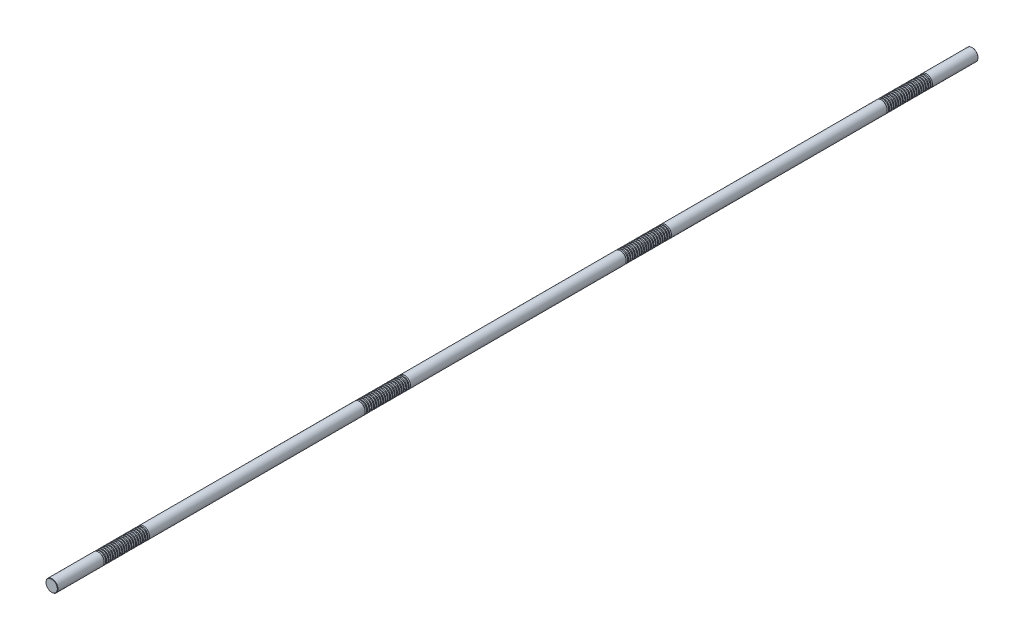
from build123d import *

# Parameters (mm, degrees)
SKETCH1_R           = 13
BOSS_EXTRUDE1_DEPTH = 1000
CHAMFER1_SIZE       = 0.65
LPATTERN1_COUNT     = 20
LPATTERN1_PITCH     = 5
LPATTERN2_COUNT     = 4
LPATTERN2_PITCH     = 567


with BuildPart() as part:
    # Sketch1 → Boss-Extrude1 (new, symmetric)
    with BuildSketch(Plane.XY):
        Circle(SKETCH1_R)
    extrude(amount=BOSS_EXTRUDE1_DEPTH, both=True)

    # Chamfer1
    chamfer1_edges = [part.edges().sort_by_distance(p)[0] for p in [
        (-13, 0, -1000),
        (-13, 0, 1000),
    ]]
    chamfer(chamfer1_edges, length=CHAMFER1_SIZE)

    # Sketch2 → Cut-Revolve1 (revolve, cut)
    with BuildSketch(Plane(origin=(0, 0, 0), x_dir=(0, 0, -1), z_dir=(1, 0, 0)), mode=Mode.PRIVATE) as cut_revolve1_sk:
        Polygon((900.36843014, 13), (897.13156986, 13), (897.86843014, 10.25), (899.63156986, 10.25), align=None)
    cut_revolve1 = revolve(cut_revolve1_sk.sketch.rotate(Axis((0, 0, 1000), (0, 0, -1)), 90), axis=Axis((0, 0, 1000), (0, 0, -1)), mode=Mode.SUBTRACT)

    # LPattern1: Cut-Revolve1 ×20
    with Locations(*[(0, 0, i * LPATTERN1_PITCH) for i in range(1, LPATTERN1_COUNT)]):
        add(cut_revolve1, mode=Mode.SUBTRACT)

    # LPattern2: Cut-Revolve1 ×4
    with Locations(*[(0, 0, i * LPATTERN2_PITCH) for i in range(1, LPATTERN2_COUNT)]):
        add(cut_revolve1, mode=Mode.SUBTRACT)

    # LPattern2 copy 1 sketch → LPattern2 copy 1 (revolve, cut)
    with BuildSketch(Plane(origin=(0, 0, 572), x_dir=(0, 0, -1), z_dir=(1, 0, 0))):
        Polygon((900.36843014, 13), (897.13156986, 13), (897.86843014, 10.25), (899.63156986, 10.25), align=None)
    revolve(axis=Axis((0, 0, 1572), (0, 0, -1)), mode=Mode.SUBTRACT)

    # LPattern2 copy 2 sketch → LPattern2 copy 2 (revolve, cut)
    with BuildSketch(Plane(origin=(0, 0, 1139), x_dir=(0, 0, -1), z_dir=(1, 0, 0))):
        Polygon((900.36843014, 13), (897.13156986, 13), (897.86843014, 10.25), (899.63156986, 10.25), align=None)
    revolve(axis=Axis((0, 0, 2139), (0, 0, -1)), mode=Mode.SUBTRACT)

    # LPattern2 copy 3 sketch → LPattern2 copy 3 (revolve, cut)
    with BuildSketch(Plane(origin=(0, 0, 1706), x_dir=(0, 0, -1), z_dir=(1, 0, 0))):
        Polygon((900.36843014, 13), (897.13156986, 13), (897.86843014, 10.25), (899.63156986, 10.25), align=None)
    revolve(axis=Axis((0, 0, 2706), (0, 0, -1)), mode=Mode.SUBTRACT)

    # LPattern2 copy 4 sketch → LPattern2 copy 4 (revolve, cut)
    with BuildSketch(Plane(origin=(0, 0, 577), x_dir=(0, 0, -1), z_dir=(1, 0, 0))):
        Polygon((900.36843014, 13), (897.13156986, 13), (897.86843014, 10.25), (899.63156986, 10.25), align=None)
    revolve(axis=Axis((0, 0, 1577), (0, 0, -1)), mode=Mode.SUBTRACT)

    # LPattern2 copy 5 sketch → LPattern2 copy 5 (revolve, cut)
    with BuildSketch(Plane(origin=(0, 0, 1144), x_dir=(0, 0, -1), z_dir=(1, 0, 0))):
        Polygon((900.36843014, 13), (897.13156986, 13), (897.86843014, 10.25), (899.63156986, 10.25), align=None)
    revolve(axis=Axis((0, 0, 2144), (0, 0, -1)), mode=Mode.SUBTRACT)

    # LPattern2 copy 6 sketch → LPattern2 copy 6 (revolve, cut)
    with BuildSketch(Plane(origin=(0, 0, 1711), x_dir=(0, 0, -1), z_dir=(1, 0, 0))):
        Polygon((900.36843014, 13), (897.13156986, 13), (897.86843014, 10.25), (899.63156986, 10.25), align=None)
    revolve(axis=Axis((0, 0, 2711), (0, 0, -1)), mode=Mode.SUBTRACT)

    # LPattern2 copy 7 sketch → LPattern2 copy 7 (revolve, cut)
    with BuildSketch(Plane(origin=(0, 0, 582), x_dir=(0, 0, -1), z_dir=(1, 0, 0))):
        Polygon((900.36843014, 13), (897.13156986, 13), (897.86843014, 10.25), (899.63156986, 10.25), align=None)
    revolve(axis=Axis((0, 0, 1582), (0, 0, -1)), mode=Mode.SUBTRACT)

    # LPattern2 copy 8 sketch → LPattern2 copy 8 (revolve, cut)
    with BuildSketch(Plane(origin=(0, 0, 1149), x_dir=(0, 0, -1), z_dir=(1, 0, 0))):
        Polygon((900.36843014, 13), (897.13156986, 13), (897.86843014, 10.25), (899.63156986, 10.25), align=None)
    revolve(axis=Axis((0, 0, 2149), (0, 0, -1)), mode=Mode.SUBTRACT)

    # LPattern2 copy 9 sketch → LPattern2 copy 9 (revolve, cut)
    with BuildSketch(Plane(origin=(0, 0, 1716), x_dir=(0, 0, -1), z_dir=(1, 0, 0))):
        Polygon((900.36843014, 13), (897.13156986, 13), (897.86843014, 10.25), (899.63156986, 10.25), align=None)
    revolve(axis=Axis((0, 0, 2716), (0, 0, -1)), mode=Mode.SUBTRACT)

    # LPattern2 copy 10 sketch → LPattern2 copy 10 (revolve, cut)
    with BuildSketch(Plane(origin=(0, 0, 587), x_dir=(0, 0, -1), z_dir=(1, 0, 0))):
        Polygon((900.36843014, 13), (897.13156986, 13), (897.86843014, 10.25), (899.63156986, 10.25), align=None)
    revolve(axis=Axis((0, 0, 1587), (0, 0, -1)), mode=Mode.SUBTRACT)

    # LPattern2 copy 11 sketch → LPattern2 copy 11 (revolve, cut)
    with BuildSketch(Plane(origin=(0, 0, 1154), x_dir=(0, 0, -1), z_dir=(1, 0, 0))):
        Polygon((900.36843014, 13), (897.13156986, 13), (897.86843014, 10.25), (899.63156986, 10.25), align=None)
    revolve(axis=Axis((0, 0, 2154), (0, 0, -1)), mode=Mode.SUBTRACT)

    # LPattern2 copy 12 sketch → LPattern2 copy 12 (revolve, cut)
    with BuildSketch(Plane(origin=(0, 0, 1721), x_dir=(0, 0, -1), z_dir=(1, 0, 0))):
        Polygon((900.36843014, 13), (897.13156986, 13), (897.86843014, 10.25), (899.63156986, 10.25), align=None)
    revolve(axis=Axis((0, 0, 2721), (0, 0, -1)), mode=Mode.SUBTRACT)

    # LPattern2 copy 13 sketch → LPattern2 copy 13 (revolve, cut)
    with BuildSketch(Plane(origin=(0, 0, 592), x_dir=(0, 0, -1), z_dir=(1, 0, 0))):
        Polygon((900.36843014, 13), (897.13156986, 13), (897.86843014, 10.25), (899.63156986, 10.25), align=None)
    revolve(axis=Axis((0, 0, 1592), (0, 0, -1)), mode=Mode.SUBTRACT)

    # LPattern2 copy 14 sketch → LPattern2 copy 14 (revolve, cut)
    with BuildSketch(Plane(origin=(0, 0, 1159), x_dir=(0, 0, -1), z_dir=(1, 0, 0))):
        Polygon((900.36843014, 13), (897.13156986, 13), (897.86843014, 10.25), (899.63156986, 10.25), align=None)
    revolve(axis=Axis((0, 0, 2159), (0, 0, -1)), mode=Mode.SUBTRACT)

    # LPattern2 copy 15 sketch → LPattern2 copy 15 (revolve, cut)
    with BuildSketch(Plane(origin=(0, 0, 1726), x_dir=(0, 0, -1), z_dir=(1, 0, 0))):
        Polygon((900.36843014, 13), (897.13156986, 13), (897.86843014, 10.25), (899.63156986, 10.25), align=None)
    revolve(axis=Axis((0, 0, 2726), (0, 0, -1)), mode=Mode.SUBTRACT)

    # LPattern2 copy 16 sketch → LPattern2 copy 16 (revolve, cut)
    with BuildSketch(Plane(origin=(0, 0, 597), x_dir=(0, 0, -1), z_dir=(1, 0, 0))):
        Polygon((900.36843014, 13), (897.13156986, 13), (897.86843014, 10.25), (899.63156986, 10.25), align=None)
    revolve(axis=Axis((0, 0, 1597), (0, 0, -1)), mode=Mode.SUBTRACT)

    # LPattern2 copy 17 sketch → LPattern2 copy 17 (revolve, cut)
    with BuildSketch(Plane(origin=(0, 0, 1164), x_dir=(0, 0, -1), z_dir=(1, 0, 0))):
        Polygon((900.36843014, 13), (897.13156986, 13), (897.86843014, 10.25), (899.63156986, 10.25), align=None)
    revolve(axis=Axis((0, 0, 2164), (0, 0, -1)), mode=Mode.SUBTRACT)

    # LPattern2 copy 18 sketch → LPattern2 copy 18 (revolve, cut)
    with BuildSketch(Plane(origin=(0, 0, 1731), x_dir=(0, 0, -1), z_dir=(1, 0, 0))):
        Polygon((900.36843014, 13), (897.13156986, 13), (897.86843014, 10.25), (899.63156986, 10.25), align=None)
    revolve(axis=Axis((0, 0, 2731), (0, 0, -1)), mode=Mode.SUBTRACT)

    # LPattern2 copy 19 sketch → LPattern2 copy 19 (revolve, cut)
    with BuildSketch(Plane(origin=(0, 0, 602), x_dir=(0, 0, -1), z_dir=(1, 0, 0))):
        Polygon((900.36843014, 13), (897.13156986, 13), (897.86843014, 10.25), (899.63156986, 10.25), align=None)
    revolve(axis=Axis((0, 0, 1602), (0, 0, -1)), mode=Mode.SUBTRACT)

    # LPattern2 copy 20 sketch → LPattern2 copy 20 (revolve, cut)
    with BuildSketch(Plane(origin=(0, 0, 1169), x_dir=(0, 0, -1), z_dir=(1, 0, 0))):
        Polygon((900.36843014, 13), (897.13156986, 13), (897.86843014, 10.25), (899.63156986, 10.25), align=None)
    revolve(axis=Axis((0, 0, 2169), (0, 0, -1)), mode=Mode.SUBTRACT)

    # LPattern2 copy 21 sketch → LPattern2 copy 21 (revolve, cut)
    with BuildSketch(Plane(origin=(0, 0, 1736), x_dir=(0, 0, -1), z_dir=(1, 0, 0))):
        Polygon((900.36843014, 13), (897.13156986, 13), (897.86843014, 10.25), (899.63156986, 10.25), align=None)
    revolve(axis=Axis((0, 0, 2736), (0, 0, -1)), mode=Mode.SUBTRACT)

    # LPattern2 copy 22 sketch → LPattern2 copy 22 (revolve, cut)
    with BuildSketch(Plane(origin=(0, 0, 607), x_dir=(0, 0, -1), z_dir=(1, 0, 0))):
        Polygon((900.36843014, 13), (897.13156986, 13), (897.86843014, 10.25), (899.63156986, 10.25), align=None)
    revolve(axis=Axis((0, 0, 1607), (0, 0, -1)), mode=Mode.SUBTRACT)

    # LPattern2 copy 23 sketch → LPattern2 copy 23 (revolve, cut)
    with BuildSketch(Plane(origin=(0, 0, 1174), x_dir=(0, 0, -1), z_dir=(1, 0, 0))):
        Polygon((900.36843014, 13), (897.13156986, 13), (897.86843014, 10.25), (899.63156986, 10.25), align=None)
    revolve(axis=Axis((0, 0, 2174), (0, 0, -1)), mode=Mode.SUBTRACT)

    # LPattern2 copy 24 sketch → LPattern2 copy 24 (revolve, cut)
    with BuildSketch(Plane(origin=(0, 0, 1741), x_dir=(0, 0, -1), z_dir=(1, 0, 0))):
        Polygon((900.36843014, 13), (897.13156986, 13), (897.86843014, 10.25), (899.63156986, 10.25), align=None)
    revolve(axis=Axis((0, 0, 2741), (0, 0, -1)), mode=Mode.SUBTRACT)

    # LPattern2 copy 25 sketch → LPattern2 copy 25 (revolve, cut)
    with BuildSketch(Plane(origin=(0, 0, 612), x_dir=(0, 0, -1), z_dir=(1, 0, 0))):
        Polygon((900.36843014, 13), (897.13156986, 13), (897.86843014, 10.25), (899.63156986, 10.25), align=None)
    revolve(axis=Axis((0, 0, 1612), (0, 0, -1)), mode=Mode.SUBTRACT)

    # LPattern2 copy 26 sketch → LPattern2 copy 26 (revolve, cut)
    with BuildSketch(Plane(origin=(0, 0, 1179), x_dir=(0, 0, -1), z_dir=(1, 0, 0))):
        Polygon((900.36843014, 13), (897.13156986, 13), (897.86843014, 10.25), (899.63156986, 10.25), align=None)
    revolve(axis=Axis((0, 0, 2179), (0, 0, -1)), mode=Mode.SUBTRACT)

    # LPattern2 copy 27 sketch → LPattern2 copy 27 (revolve, cut)
    with BuildSketch(Plane(origin=(0, 0, 1746), x_dir=(0, 0, -1), z_dir=(1, 0, 0))):
        Polygon((900.36843014, 13), (897.13156986, 13), (897.86843014, 10.25), (899.63156986, 10.25), align=None)
    revolve(axis=Axis((0, 0, 2746), (0, 0, -1)), mode=Mode.SUBTRACT)

    # LPattern2 copy 28 sketch → LPattern2 copy 28 (revolve, cut)
    with BuildSketch(Plane(origin=(0, 0, 617), x_dir=(0, 0, -1), z_dir=(1, 0, 0))):
        Polygon((900.36843014, 13), (897.13156986, 13), (897.86843014, 10.25), (899.63156986, 10.25), align=None)
    revolve(axis=Axis((0, 0, 1617), (0, 0, -1)), mode=Mode.SUBTRACT)

    # LPattern2 copy 29 sketch → LPattern2 copy 29 (revolve, cut)
    with BuildSketch(Plane(origin=(0, 0, 1184), x_dir=(0, 0, -1), z_dir=(1, 0, 0))):
        Polygon((900.36843014, 13), (897.13156986, 13), (897.86843014, 10.25), (899.63156986, 10.25), align=None)
    revolve(axis=Axis((0, 0, 2184), (0, 0, -1)), mode=Mode.SUBTRACT)

    # LPattern2 copy 30 sketch → LPattern2 copy 30 (revolve, cut)
    with BuildSketch(Plane(origin=(0, 0, 1751), x_dir=(0, 0, -1), z_dir=(1, 0, 0))):
        Polygon((900.36843014, 13), (897.13156986, 13), (897.86843014, 10.25), (899.63156986, 10.25), align=None)
    revolve(axis=Axis((0, 0, 2751), (0, 0, -1)), mode=Mode.SUBTRACT)

    # LPattern2 copy 31 sketch → LPattern2 copy 31 (revolve, cut)
    with BuildSketch(Plane(origin=(0, 0, 622), x_dir=(0, 0, -1), z_dir=(1, 0, 0))):
        Polygon((900.36843014, 13), (897.13156986, 13), (897.86843014, 10.25), (899.63156986, 10.25), align=None)
    revolve(axis=Axis((0, 0, 1622), (0, 0, -1)), mode=Mode.SUBTRACT)

    # LPattern2 copy 32 sketch → LPattern2 copy 32 (revolve, cut)
    with BuildSketch(Plane(origin=(0, 0, 1189), x_dir=(0, 0, -1), z_dir=(1, 0, 0))):
        Polygon((900.36843014, 13), (897.13156986, 13), (897.86843014, 10.25), (899.63156986, 10.25), align=None)
    revolve(axis=Axis((0, 0, 2189), (0, 0, -1)), mode=Mode.SUBTRACT)

    # LPattern2 copy 33 sketch → LPattern2 copy 33 (revolve, cut)
    with BuildSketch(Plane(origin=(0, 0, 1756), x_dir=(0, 0, -1), z_dir=(1, 0, 0))):
        Polygon((900.36843014, 13), (897.13156986, 13), (897.86843014, 10.25), (899.63156986, 10.25), align=None)
    revolve(axis=Axis((0, 0, 2756), (0, 0, -1)), mode=Mode.SUBTRACT)

    # LPattern2 copy 34 sketch → LPattern2 copy 34 (revolve, cut)
    with BuildSketch(Plane(origin=(0, 0, 627), x_dir=(0, 0, -1), z_dir=(1, 0, 0))):
        Polygon((900.36843014, 13), (897.13156986, 13), (897.86843014, 10.25), (899.63156986, 10.25), align=None)
    revolve(axis=Axis((0, 0, 1627), (0, 0, -1)), mode=Mode.SUBTRACT)

    # LPattern2 copy 35 sketch → LPattern2 copy 35 (revolve, cut)
    with BuildSketch(Plane(origin=(0, 0, 1194), x_dir=(0, 0, -1), z_dir=(1, 0, 0))):
        Polygon((900.36843014, 13), (897.13156986, 13), (897.86843014, 10.25), (899.63156986, 10.25), align=None)
    revolve(axis=Axis((0, 0, 2194), (0, 0, -1)), mode=Mode.SUBTRACT)

    # LPattern2 copy 36 sketch → LPattern2 copy 36 (revolve, cut)
    with BuildSketch(Plane(origin=(0, 0, 1761), x_dir=(0, 0, -1), z_dir=(1, 0, 0))):
        Polygon((900.36843014, 13), (897.13156986, 13), (897.86843014, 10.25), (899.63156986, 10.25), align=None)
    revolve(axis=Axis((0, 0, 2761), (0, 0, -1)), mode=Mode.SUBTRACT)

    # LPattern2 copy 37 sketch → LPattern2 copy 37 (revolve, cut)
    with BuildSketch(Plane(origin=(0, 0, 632), x_dir=(0, 0, -1), z_dir=(1, 0, 0))):
        Polygon((900.36843014, 13), (897.13156986, 13), (897.86843014, 10.25), (899.63156986, 10.25), align=None)
    revolve(axis=Axis((0, 0, 1632), (0, 0, -1)), mode=Mode.SUBTRACT)

    # LPattern2 copy 38 sketch → LPattern2 copy 38 (revolve, cut)
    with BuildSketch(Plane(origin=(0, 0, 1199), x_dir=(0, 0, -1), z_dir=(1, 0, 0))):
        Polygon((900.36843014, 13), (897.13156986, 13), (897.86843014, 10.25), (899.63156986, 10.25), align=None)
    revolve(axis=Axis((0, 0, 2199), (0, 0, -1)), mode=Mode.SUBTRACT)

    # LPattern2 copy 39 sketch → LPattern2 copy 39 (revolve, cut)
    with BuildSketch(Plane(origin=(0, 0, 1766), x_dir=(0, 0, -1), z_dir=(1, 0, 0))):
        Polygon((900.36843014, 13), (897.13156986, 13), (897.86843014, 10.25), (899.63156986, 10.25), align=None)
    revolve(axis=Axis((0, 0, 2766), (0, 0, -1)), mode=Mode.SUBTRACT)

    # LPattern2 copy 40 sketch → LPattern2 copy 40 (revolve, cut)
    with BuildSketch(Plane(origin=(0, 0, 637), x_dir=(0, 0, -1), z_dir=(1, 0, 0))):
        Polygon((900.36843014, 13), (897.13156986, 13), (897.86843014, 10.25), (899.63156986, 10.25), align=None)
    revolve(axis=Axis((0, 0, 1637), (0, 0, -1)), mode=Mode.SUBTRACT)

    # LPattern2 copy 41 sketch → LPattern2 copy 41 (revolve, cut)
    with BuildSketch(Plane(origin=(0, 0, 1204), x_dir=(0, 0, -1), z_dir=(1, 0, 0))):
        Polygon((900.36843014, 13), (897.13156986, 13), (897.86843014, 10.25), (899.63156986, 10.25), align=None)
    revolve(axis=Axis((0, 0, 2204), (0, 0, -1)), mode=Mode.SUBTRACT)

    # LPattern2 copy 42 sketch → LPattern2 copy 42 (revolve, cut)
    with BuildSketch(Plane(origin=(0, 0, 1771), x_dir=(0, 0, -1), z_dir=(1, 0, 0))):
        Polygon((900.36843014, 13), (897.13156986, 13), (897.86843014, 10.25), (899.63156986, 10.25), align=None)
    revolve(axis=Axis((0, 0, 2771), (0, 0, -1)), mode=Mode.SUBTRACT)

    # LPattern2 copy 43 sketch → LPattern2 copy 43 (revolve, cut)
    with BuildSketch(Plane(origin=(0, 0, 642), x_dir=(0, 0, -1), z_dir=(1, 0, 0))):
        Polygon((900.36843014, 13), (897.13156986, 13), (897.86843014, 10.25), (899.63156986, 10.25), align=None)
    revolve(axis=Axis((0, 0, 1642), (0, 0, -1)), mode=Mode.SUBTRACT)

    # LPattern2 copy 44 sketch → LPattern2 copy 44 (revolve, cut)
    with BuildSketch(Plane(origin=(0, 0, 1209), x_dir=(0, 0, -1), z_dir=(1, 0, 0))):
        Polygon((900.36843014, 13), (897.13156986, 13), (897.86843014, 10.25), (899.63156986, 10.25), align=None)
    revolve(axis=Axis((0, 0, 2209), (0, 0, -1)), mode=Mode.SUBTRACT)

    # LPattern2 copy 45 sketch → LPattern2 copy 45 (revolve, cut)
    with BuildSketch(Plane(origin=(0, 0, 1776), x_dir=(0, 0, -1), z_dir=(1, 0, 0))):
        Polygon((900.36843014, 13), (897.13156986, 13), (897.86843014, 10.25), (899.63156986, 10.25), align=None)
    revolve(axis=Axis((0, 0, 2776), (0, 0, -1)), mode=Mode.SUBTRACT)

    # LPattern2 copy 46 sketch → LPattern2 copy 46 (revolve, cut)
    with BuildSketch(Plane(origin=(0, 0, 647), x_dir=(0, 0, -1), z_dir=(1, 0, 0))):
        Polygon((900.36843014, 13), (897.13156986, 13), (897.86843014, 10.25), (899.63156986, 10.25), align=None)
    revolve(axis=Axis((0, 0, 1647), (0, 0, -1)), mode=Mode.SUBTRACT)

    # LPattern2 copy 47 sketch → LPattern2 copy 47 (revolve, cut)
    with BuildSketch(Plane(origin=(0, 0, 1214), x_dir=(0, 0, -1), z_dir=(1, 0, 0))):
        Polygon((900.36843014, 13), (897.13156986, 13), (897.86843014, 10.25), (899.63156986, 10.25), align=None)
    revolve(axis=Axis((0, 0, 2214), (0, 0, -1)), mode=Mode.SUBTRACT)

    # LPattern2 copy 48 sketch → LPattern2 copy 48 (revolve, cut)
    with BuildSketch(Plane(origin=(0, 0, 1781), x_dir=(0, 0, -1), z_dir=(1, 0, 0))):
        Polygon((900.36843014, 13), (897.13156986, 13), (897.86843014, 10.25), (899.63156986, 10.25), align=None)
    revolve(axis=Axis((0, 0, 2781), (0, 0, -1)), mode=Mode.SUBTRACT)

    # LPattern2 copy 49 sketch → LPattern2 copy 49 (revolve, cut)
    with BuildSketch(Plane(origin=(0, 0, 652), x_dir=(0, 0, -1), z_dir=(1, 0, 0))):
        Polygon((900.36843014, 13), (897.13156986, 13), (897.86843014, 10.25), (899.63156986, 10.25), align=None)
    revolve(axis=Axis((0, 0, 1652), (0, 0, -1)), mode=Mode.SUBTRACT)

    # LPattern2 copy 50 sketch → LPattern2 copy 50 (revolve, cut)
    with BuildSketch(Plane(origin=(0, 0, 1219), x_dir=(0, 0, -1), z_dir=(1, 0, 0))):
        Polygon((900.36843014, 13), (897.13156986, 13), (897.86843014, 10.25), (899.63156986, 10.25), align=None)
    revolve(axis=Axis((0, 0, 2219), (0, 0, -1)), mode=Mode.SUBTRACT)

    # LPattern2 copy 51 sketch → LPattern2 copy 51 (revolve, cut)
    with BuildSketch(Plane(origin=(0, 0, 1786), x_dir=(0, 0, -1), z_dir=(1, 0, 0))):
        Polygon((900.36843014, 13), (897.13156986, 13), (897.86843014, 10.25), (899.63156986, 10.25), align=None)
    revolve(axis=Axis((0, 0, 2786), (0, 0, -1)), mode=Mode.SUBTRACT)

    # LPattern2 copy 52 sketch → LPattern2 copy 52 (revolve, cut)
    with BuildSketch(Plane(origin=(0, 0, 657), x_dir=(0, 0, -1), z_dir=(1, 0, 0))):
        Polygon((900.36843014, 13), (897.13156986, 13), (897.86843014, 10.25), (899.63156986, 10.25), align=None)
    revolve(axis=Axis((0, 0, 1657), (0, 0, -1)), mode=Mode.SUBTRACT)

    # LPattern2 copy 53 sketch → LPattern2 copy 53 (revolve, cut)
    with BuildSketch(Plane(origin=(0, 0, 1224), x_dir=(0, 0, -1), z_dir=(1, 0, 0))):
        Polygon((900.36843014, 13), (897.13156986, 13), (897.86843014, 10.25), (899.63156986, 10.25), align=None)
    revolve(axis=Axis((0, 0, 2224), (0, 0, -1)), mode=Mode.SUBTRACT)

    # LPattern2 copy 54 sketch → LPattern2 copy 54 (revolve, cut)
    with BuildSketch(Plane(origin=(0, 0, 1791), x_dir=(0, 0, -1), z_dir=(1, 0, 0))):
        Polygon((900.36843014, 13), (897.13156986, 13), (897.86843014, 10.25), (899.63156986, 10.25), align=None)
    revolve(axis=Axis((0, 0, 2791), (0, 0, -1)), mode=Mode.SUBTRACT)

    # LPattern2 copy 55 sketch → LPattern2 copy 55 (revolve, cut)
    with BuildSketch(Plane(origin=(0, 0, 662), x_dir=(0, 0, -1), z_dir=(1, 0, 0))):
        Polygon((900.36843014, 13), (897.13156986, 13), (897.86843014, 10.25), (899.63156986, 10.25), align=None)
    revolve(axis=Axis((0, 0, 1662), (0, 0, -1)), mode=Mode.SUBTRACT)

    # LPattern2 copy 56 sketch → LPattern2 copy 56 (revolve, cut)
    with BuildSketch(Plane(origin=(0, 0, 1229), x_dir=(0, 0, -1), z_dir=(1, 0, 0))):
        Polygon((900.36843014, 13), (897.13156986, 13), (897.86843014, 10.25), (899.63156986, 10.25), align=None)
    revolve(axis=Axis((0, 0, 2229), (0, 0, -1)), mode=Mode.SUBTRACT)

    # LPattern2 copy 57 sketch → LPattern2 copy 57 (revolve, cut)
    with BuildSketch(Plane(origin=(0, 0, 1796), x_dir=(0, 0, -1), z_dir=(1, 0, 0))):
        Polygon((900.36843014, 13), (897.13156986, 13), (897.86843014, 10.25), (899.63156986, 10.25), align=None)
    revolve(axis=Axis((0, 0, 2796), (0, 0, -1)), mode=Mode.SUBTRACT)


solid = part.part
